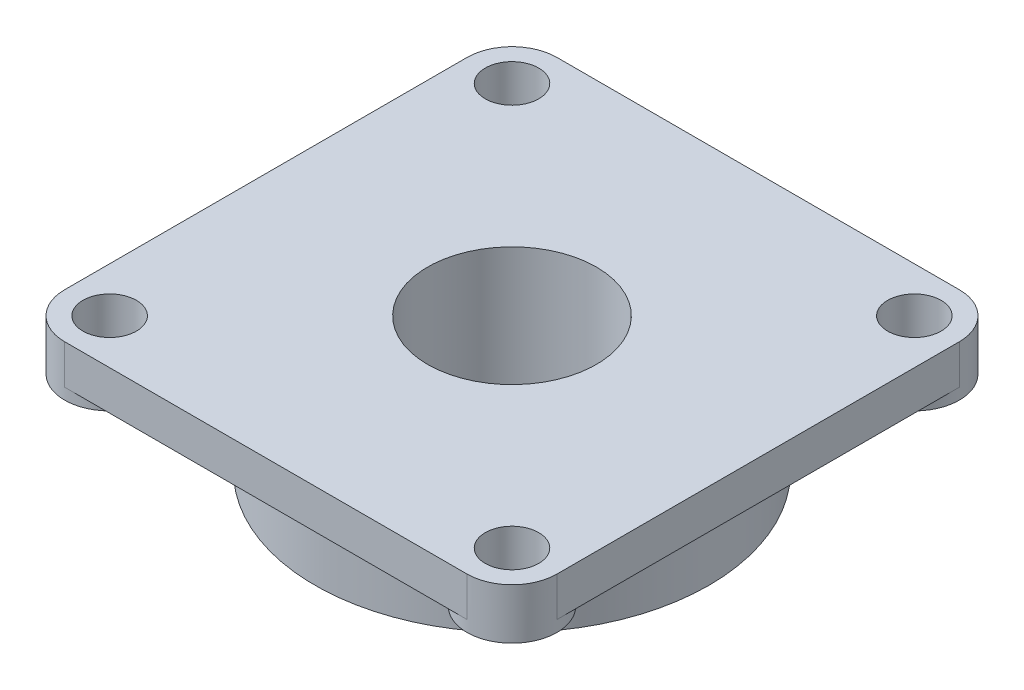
ISO-10303-21;
HEADER;
FILE_DESCRIPTION(('STEP AP214'),'2;1');
FILE_NAME('part.step','',(''),(''),'','','');
FILE_SCHEMA(('AUTOMOTIVE_DESIGN { 1 0 10303 214 1 1 1 1 }'));
ENDSEC;
DATA;
#1=APPLICATION_CONTEXT('core data for automotive mechanical design processes');
#2=APPLICATION_PROTOCOL_DEFINITION('international standard','automotive_design',2000,#1);
#3=PRODUCT_CONTEXT('',#1,'mechanical');
#4=PRODUCT('Part','Part','',(#3));
#5=PRODUCT_RELATED_PRODUCT_CATEGORY('part','',(#4));
#6=PRODUCT_DEFINITION_FORMATION('','',#4);
#7=PRODUCT_DEFINITION_CONTEXT('part definition',#1,'design');
#8=PRODUCT_DEFINITION('design','',#6,#7);
#9=PRODUCT_DEFINITION_SHAPE('','',#8);
#10=(LENGTH_UNIT() NAMED_UNIT(*) SI_UNIT(.MILLI.,.METRE.));
#11=(NAMED_UNIT(*) PLANE_ANGLE_UNIT() SI_UNIT($,.RADIAN.));
#12=(NAMED_UNIT(*) SI_UNIT($,.STERADIAN.) SOLID_ANGLE_UNIT());
#13=UNCERTAINTY_MEASURE_WITH_UNIT(LENGTH_MEASURE(1.E-05),#10,'distance_accuracy_value','');
#14=(GEOMETRIC_REPRESENTATION_CONTEXT(3) GLOBAL_UNCERTAINTY_ASSIGNED_CONTEXT((#13)) GLOBAL_UNIT_ASSIGNED_CONTEXT((#10,
#11,#12)) REPRESENTATION_CONTEXT('',''));
#15=CARTESIAN_POINT('',(0.,0.,0.));
#16=DIRECTION('',(0.,0.,1.));
#17=DIRECTION('',(1.,0.,0.));
#18=AXIS2_PLACEMENT_3D('',#15,#16,#17);
#19=CARTESIAN_POINT('',(-71.5,0.,71.5));
#20=DIRECTION('',(0.,-1.,0.));
#21=DIRECTION('',(0.,0.,-1.));
#22=AXIS2_PLACEMENT_3D('',#19,#20,#21);
#23=CYLINDRICAL_SURFACE('',#22,9.5);
#24=CARTESIAN_POINT('',(-71.5,0.,71.5));
#25=DIRECTION('',(0.,-1.,0.));
#26=DIRECTION('',(0.,0.,-1.));
#27=AXIS2_PLACEMENT_3D('',#24,#25,#26);
#28=CIRCLE('',#27,9.5);
#29=CARTESIAN_POINT('',(-71.5,0.,62.));
#30=VERTEX_POINT('',#29);
#31=EDGE_CURVE('E406',#30,#30,#28,.F.);
#32=ORIENTED_EDGE('',*,*,#31,.T.);
#33=EDGE_LOOP('',(#32));
#34=FACE_BOUND('',#33,.T.);
#35=CARTESIAN_POINT('',(-71.5,-18.,71.5));
#36=DIRECTION('',(0.,-1.,0.));
#37=DIRECTION('',(0.,0.,-1.));
#38=AXIS2_PLACEMENT_3D('',#35,#36,#37);
#39=CIRCLE('',#38,9.5);
#40=CARTESIAN_POINT('',(-71.5,-18.,62.));
#41=VERTEX_POINT('',#40);
#42=EDGE_CURVE('E212',#41,#41,#39,.F.);
#43=ORIENTED_EDGE('',*,*,#42,.F.);
#44=EDGE_LOOP('',(#43));
#45=FACE_BOUND('',#44,.T.);
#46=ADVANCED_FACE('F16',(#34,#45),#23,.F.);
#47=CARTESIAN_POINT('',(-87.5,0.,-71.5));
#48=DIRECTION('',(-1.,0.,0.));
#49=DIRECTION('',(0.,-1.,0.));
#50=AXIS2_PLACEMENT_3D('',#47,#48,#49);
#51=PLANE('',#50);
#52=DIRECTION('',(0.,0.,-1.));
#53=VECTOR('',#52,1.);
#54=CARTESIAN_POINT('',(-87.5,0.,0.));
#55=LINE('',#54,#53);
#56=CARTESIAN_POINT('',(-87.5,0.,71.5));
#57=VERTEX_POINT('',#56);
#58=CARTESIAN_POINT('',(-87.5,0.,-71.5));
#59=VERTEX_POINT('',#58);
#60=EDGE_CURVE('E418',#57,#59,#55,.T.);
#61=ORIENTED_EDGE('',*,*,#60,.T.);
#62=DIRECTION('',(0.,-1.,0.));
#63=VECTOR('',#62,1.);
#64=CARTESIAN_POINT('',(-87.5,0.,-71.5));
#65=LINE('',#64,#63);
#66=CARTESIAN_POINT('',(-87.5,-14.,-71.5));
#67=VERTEX_POINT('',#66);
#68=EDGE_CURVE('E337',#67,#59,#65,.F.);
#69=ORIENTED_EDGE('',*,*,#68,.F.);
#70=DIRECTION('',(0.,0.,-1.));
#71=VECTOR('',#70,1.);
#72=CARTESIAN_POINT('',(-87.5,-14.,0.));
#73=LINE('',#72,#71);
#74=CARTESIAN_POINT('',(-87.5,-14.,71.5));
#75=VERTEX_POINT('',#74);
#76=EDGE_CURVE('E213',#75,#67,#73,.T.);
#77=ORIENTED_EDGE('',*,*,#76,.F.);
#78=DIRECTION('',(0.,-1.,0.));
#79=VECTOR('',#78,1.);
#80=CARTESIAN_POINT('',(-87.5,0.,71.5));
#81=LINE('',#80,#79);
#82=EDGE_CURVE('E341',#75,#57,#81,.F.);
#83=ORIENTED_EDGE('',*,*,#82,.T.);
#84=EDGE_LOOP('',(#61,#69,#77,#83));
#85=FACE_BOUND('',#84,.T.);
#86=ADVANCED_FACE('F429',(#85),#51,.T.);
#87=CARTESIAN_POINT('',(-71.5,0.,-71.5));
#88=DIRECTION('',(0.,-1.,0.));
#89=DIRECTION('',(0.,0.,-1.));
#90=AXIS2_PLACEMENT_3D('',#87,#88,#89);
#91=CYLINDRICAL_SURFACE('',#90,9.5);
#92=CARTESIAN_POINT('',(-71.5,0.,-71.5));
#93=DIRECTION('',(0.,-1.,0.));
#94=DIRECTION('',(0.,0.,-1.));
#95=AXIS2_PLACEMENT_3D('',#92,#93,#94);
#96=CIRCLE('',#95,9.5);
#97=CARTESIAN_POINT('',(-71.5,0.,-81.));
#98=VERTEX_POINT('',#97);
#99=EDGE_CURVE('E409',#98,#98,#96,.F.);
#100=ORIENTED_EDGE('',*,*,#99,.T.);
#101=EDGE_LOOP('',(#100));
#102=FACE_BOUND('',#101,.T.);
#103=CARTESIAN_POINT('',(-71.5,-18.,-71.5));
#104=DIRECTION('',(0.,-1.,0.));
#105=DIRECTION('',(0.,0.,-1.));
#106=AXIS2_PLACEMENT_3D('',#103,#104,#105);
#107=CIRCLE('',#106,9.5);
#108=CARTESIAN_POINT('',(-71.5,-18.,-81.));
#109=VERTEX_POINT('',#108);
#110=EDGE_CURVE('E302',#109,#109,#107,.F.);
#111=ORIENTED_EDGE('',*,*,#110,.F.);
#112=EDGE_LOOP('',(#111));
#113=FACE_BOUND('',#112,.T.);
#114=ADVANCED_FACE('F693',(#102,#113),#91,.F.);
#115=CARTESIAN_POINT('',(-71.5,0.,-71.5));
#116=DIRECTION('',(0.,-1.,0.));
#117=DIRECTION('',(0.,0.,-1.));
#118=AXIS2_PLACEMENT_3D('',#115,#116,#117);
#119=CYLINDRICAL_SURFACE('',#118,16.);
#120=DIRECTION('',(0.,1.,0.));
#121=VECTOR('',#120,1.);
#122=CARTESIAN_POINT('',(-60.1862915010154,0.,-82.8137084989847));
#123=LINE('',#122,#121);
#124=CARTESIAN_POINT('',(-60.1862915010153,-18.,-82.8137084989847));
#125=VERTEX_POINT('',#124);
#126=CARTESIAN_POINT('',(-60.1862915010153,-14.,-82.8137084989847));
#127=VERTEX_POINT('',#126);
#128=EDGE_CURVE('E235',#125,#127,#123,.T.);
#129=ORIENTED_EDGE('',*,*,#128,.F.);
#130=CARTESIAN_POINT('',(-71.5,-18.,-71.5));
#131=DIRECTION('',(0.,-1.,0.));
#132=DIRECTION('',(0.,0.,-1.));
#133=AXIS2_PLACEMENT_3D('',#130,#131,#132);
#134=CIRCLE('',#133,16.);
#135=CARTESIAN_POINT('',(-82.8137084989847,-18.,-60.1862915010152));
#136=VERTEX_POINT('',#135);
#137=EDGE_CURVE('E225',#136,#125,#134,.T.);
#138=ORIENTED_EDGE('',*,*,#137,.F.);
#139=DIRECTION('',(0.,1.,0.));
#140=VECTOR('',#139,1.);
#141=CARTESIAN_POINT('',(-82.8137084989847,0.,-60.1862915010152));
#142=LINE('',#141,#140);
#143=CARTESIAN_POINT('',(-82.8137084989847,-14.,-60.1862915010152));
#144=VERTEX_POINT('',#143);
#145=EDGE_CURVE('E226',#144,#136,#142,.F.);
#146=ORIENTED_EDGE('',*,*,#145,.F.);
#147=CARTESIAN_POINT('',(-71.5,-14.,-71.5));
#148=DIRECTION('',(0.,-1.,0.));
#149=DIRECTION('',(0.,0.,-1.));
#150=AXIS2_PLACEMENT_3D('',#147,#148,#149);
#151=CIRCLE('',#150,16.);
#152=EDGE_CURVE('E216',#67,#144,#151,.F.);
#153=ORIENTED_EDGE('',*,*,#152,.F.);
#154=ORIENTED_EDGE('',*,*,#68,.T.);
#155=CARTESIAN_POINT('',(-71.5,0.,-71.5));
#156=DIRECTION('',(0.,-1.,0.));
#157=DIRECTION('',(0.,0.,-1.));
#158=AXIS2_PLACEMENT_3D('',#155,#156,#157);
#159=CIRCLE('',#158,16.);
#160=CARTESIAN_POINT('',(-71.5,0.,-87.5));
#161=VERTEX_POINT('',#160);
#162=EDGE_CURVE('E416',#59,#161,#159,.T.);
#163=ORIENTED_EDGE('',*,*,#162,.T.);
#164=DIRECTION('',(0.,1.,0.));
#165=VECTOR('',#164,1.);
#166=CARTESIAN_POINT('',(-71.5,0.,-87.5));
#167=LINE('',#166,#165);
#168=CARTESIAN_POINT('',(-71.5,-14.,-87.5));
#169=VERTEX_POINT('',#168);
#170=EDGE_CURVE('E334',#169,#161,#167,.T.);
#171=ORIENTED_EDGE('',*,*,#170,.F.);
#172=CARTESIAN_POINT('',(-71.5,-14.,-71.5));
#173=DIRECTION('',(0.,-1.,0.));
#174=DIRECTION('',(0.,0.,-1.));
#175=AXIS2_PLACEMENT_3D('',#172,#173,#174);
#176=CIRCLE('',#175,16.);
#177=EDGE_CURVE('E231',#127,#169,#176,.F.);
#178=ORIENTED_EDGE('',*,*,#177,.F.);
#179=EDGE_LOOP('',(#129,#138,#146,#153,#154,#163,#171,#178));
#180=FACE_BOUND('',#179,.T.);
#181=ADVANCED_FACE('F434',(#180),#119,.T.);
#182=CARTESIAN_POINT('',(71.5,0.,-87.5));
#183=DIRECTION('',(0.,0.,-1.));
#184=DIRECTION('',(0.,1.,0.));
#185=AXIS2_PLACEMENT_3D('',#182,#183,#184);
#186=PLANE('',#185);
#187=DIRECTION('',(1.,0.,0.));
#188=VECTOR('',#187,1.);
#189=CARTESIAN_POINT('',(0.,0.,-87.5));
#190=LINE('',#189,#188);
#191=CARTESIAN_POINT('',(71.5,0.,-87.5));
#192=VERTEX_POINT('',#191);
#193=EDGE_CURVE('E415',#161,#192,#190,.T.);
#194=ORIENTED_EDGE('',*,*,#193,.T.);
#195=DIRECTION('',(0.,-1.,0.));
#196=VECTOR('',#195,1.);
#197=CARTESIAN_POINT('',(71.5,0.,-87.5));
#198=LINE('',#197,#196);
#199=CARTESIAN_POINT('',(71.5,-14.,-87.5));
#200=VERTEX_POINT('',#199);
#201=EDGE_CURVE('E175',#200,#192,#198,.F.);
#202=ORIENTED_EDGE('',*,*,#201,.F.);
#203=DIRECTION('',(1.,0.,0.));
#204=VECTOR('',#203,1.);
#205=CARTESIAN_POINT('',(0.,-14.,-87.5));
#206=LINE('',#205,#204);
#207=EDGE_CURVE('E227',#169,#200,#206,.T.);
#208=ORIENTED_EDGE('',*,*,#207,.F.);
#209=ORIENTED_EDGE('',*,*,#170,.T.);
#210=EDGE_LOOP('',(#194,#202,#208,#209));
#211=FACE_BOUND('',#210,.T.);
#212=ADVANCED_FACE('F480',(#211),#186,.T.);
#213=CARTESIAN_POINT('',(71.5,0.,-71.5));
#214=DIRECTION('',(0.,-1.,0.));
#215=DIRECTION('',(0.,0.,-1.));
#216=AXIS2_PLACEMENT_3D('',#213,#214,#215);
#217=CYLINDRICAL_SURFACE('',#216,9.5);
#218=CARTESIAN_POINT('',(71.5,0.,-71.5));
#219=DIRECTION('',(0.,-1.,0.));
#220=DIRECTION('',(0.,0.,-1.));
#221=AXIS2_PLACEMENT_3D('',#218,#219,#220);
#222=CIRCLE('',#221,9.5);
#223=CARTESIAN_POINT('',(71.5,0.,-81.));
#224=VERTEX_POINT('',#223);
#225=EDGE_CURVE('E412',#224,#224,#222,.F.);
#226=ORIENTED_EDGE('',*,*,#225,.T.);
#227=EDGE_LOOP('',(#226));
#228=FACE_BOUND('',#227,.T.);
#229=CARTESIAN_POINT('',(71.5,-18.,-71.5));
#230=DIRECTION('',(0.,-1.,0.));
#231=DIRECTION('',(0.,0.,-1.));
#232=AXIS2_PLACEMENT_3D('',#229,#230,#231);
#233=CIRCLE('',#232,9.5);
#234=CARTESIAN_POINT('',(71.5,-18.,-81.));
#235=VERTEX_POINT('',#234);
#236=EDGE_CURVE('E287',#235,#235,#233,.F.);
#237=ORIENTED_EDGE('',*,*,#236,.F.);
#238=EDGE_LOOP('',(#237));
#239=FACE_BOUND('',#238,.T.);
#240=ADVANCED_FACE('F671',(#228,#239),#217,.F.);
#241=CARTESIAN_POINT('',(71.5,0.,-71.5));
#242=DIRECTION('',(0.,-1.,0.));
#243=DIRECTION('',(0.,0.,-1.));
#244=AXIS2_PLACEMENT_3D('',#241,#242,#243);
#245=CYLINDRICAL_SURFACE('',#244,16.);
#246=DIRECTION('',(0.,1.,0.));
#247=VECTOR('',#246,1.);
#248=CARTESIAN_POINT('',(82.8137084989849,0.,-60.1862915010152));
#249=LINE('',#248,#247);
#250=CARTESIAN_POINT('',(82.8137084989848,-18.,-60.1862915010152));
#251=VERTEX_POINT('',#250);
#252=CARTESIAN_POINT('',(82.8137084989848,-14.,-60.1862915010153));
#253=VERTEX_POINT('',#252);
#254=EDGE_CURVE('E247',#251,#253,#249,.T.);
#255=ORIENTED_EDGE('',*,*,#254,.F.);
#256=CARTESIAN_POINT('',(71.5,-18.,-71.5));
#257=DIRECTION('',(0.,-1.,0.));
#258=DIRECTION('',(0.,0.,-1.));
#259=AXIS2_PLACEMENT_3D('',#256,#257,#258);
#260=CIRCLE('',#259,16.);
#261=CARTESIAN_POINT('',(60.1862915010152,-18.,-82.8137084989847));
#262=VERTEX_POINT('',#261);
#263=EDGE_CURVE('E239',#262,#251,#260,.T.);
#264=ORIENTED_EDGE('',*,*,#263,.F.);
#265=DIRECTION('',(0.,1.,0.));
#266=VECTOR('',#265,1.);
#267=CARTESIAN_POINT('',(60.1862915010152,0.,-82.8137084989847));
#268=LINE('',#267,#266);
#269=CARTESIAN_POINT('',(60.1862915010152,-14.,-82.8137084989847));
#270=VERTEX_POINT('',#269);
#271=EDGE_CURVE('E240',#270,#262,#268,.F.);
#272=ORIENTED_EDGE('',*,*,#271,.F.);
#273=CARTESIAN_POINT('',(71.5,-14.,-71.5));
#274=DIRECTION('',(0.,-1.,0.));
#275=DIRECTION('',(0.,0.,-1.));
#276=AXIS2_PLACEMENT_3D('',#273,#274,#275);
#277=CIRCLE('',#276,16.);
#278=EDGE_CURVE('E230',#200,#270,#277,.F.);
#279=ORIENTED_EDGE('',*,*,#278,.F.);
#280=ORIENTED_EDGE('',*,*,#201,.T.);
#281=CARTESIAN_POINT('',(71.5,0.,-71.5));
#282=DIRECTION('',(0.,-1.,0.));
#283=DIRECTION('',(0.,0.,-1.));
#284=AXIS2_PLACEMENT_3D('',#281,#282,#283);
#285=CIRCLE('',#284,16.);
#286=CARTESIAN_POINT('',(87.5,0.,-71.5));
#287=VERTEX_POINT('',#286);
#288=EDGE_CURVE('E20',#192,#287,#285,.T.);
#289=ORIENTED_EDGE('',*,*,#288,.T.);
#290=DIRECTION('',(0.,1.,0.));
#291=VECTOR('',#290,1.);
#292=CARTESIAN_POINT('',(87.5,0.,-71.5));
#293=LINE('',#292,#291);
#294=CARTESIAN_POINT('',(87.5,-14.,-71.5));
#295=VERTEX_POINT('',#294);
#296=EDGE_CURVE('E182',#295,#287,#293,.T.);
#297=ORIENTED_EDGE('',*,*,#296,.F.);
#298=CARTESIAN_POINT('',(71.5,-14.,-71.5));
#299=DIRECTION('',(0.,-1.,0.));
#300=DIRECTION('',(0.,0.,-1.));
#301=AXIS2_PLACEMENT_3D('',#298,#299,#300);
#302=CIRCLE('',#301,16.);
#303=EDGE_CURVE('E243',#253,#295,#302,.F.);
#304=ORIENTED_EDGE('',*,*,#303,.F.);
#305=EDGE_LOOP('',(#255,#264,#272,#279,#280,#289,#297,#304));
#306=FACE_BOUND('',#305,.T.);
#307=ADVANCED_FACE('F180',(#306),#245,.T.);
#308=CARTESIAN_POINT('',(87.5,0.,71.5));
#309=DIRECTION('',(1.,0.,0.));
#310=DIRECTION('',(0.,1.,0.));
#311=AXIS2_PLACEMENT_3D('',#308,#309,#310);
#312=PLANE('',#311);
#313=DIRECTION('',(0.,0.,-1.));
#314=VECTOR('',#313,1.);
#315=CARTESIAN_POINT('',(87.5,0.,0.));
#316=LINE('',#315,#314);
#317=CARTESIAN_POINT('',(87.5,0.,71.5));
#318=VERTEX_POINT('',#317);
#319=EDGE_CURVE('E187',#287,#318,#316,.F.);
#320=ORIENTED_EDGE('',*,*,#319,.T.);
#321=DIRECTION('',(0.,-1.,0.));
#322=VECTOR('',#321,1.);
#323=CARTESIAN_POINT('',(87.5,0.,71.5));
#324=LINE('',#323,#322);
#325=CARTESIAN_POINT('',(87.5,-14.,71.5));
#326=VERTEX_POINT('',#325);
#327=EDGE_CURVE('E195',#326,#318,#324,.F.);
#328=ORIENTED_EDGE('',*,*,#327,.F.);
#329=DIRECTION('',(0.,0.,-1.));
#330=VECTOR('',#329,1.);
#331=CARTESIAN_POINT('',(87.5,-14.,0.));
#332=LINE('',#331,#330);
#333=EDGE_CURVE('E193',#295,#326,#332,.F.);
#334=ORIENTED_EDGE('',*,*,#333,.F.);
#335=ORIENTED_EDGE('',*,*,#296,.T.);
#336=EDGE_LOOP('',(#320,#328,#334,#335));
#337=FACE_BOUND('',#336,.T.);
#338=ADVANCED_FACE('F190',(#337),#312,.T.);
#339=CARTESIAN_POINT('',(71.5000000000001,0.,71.5));
#340=DIRECTION('',(0.,-1.,0.));
#341=DIRECTION('',(0.,0.,-1.));
#342=AXIS2_PLACEMENT_3D('',#339,#340,#341);
#343=CYLINDRICAL_SURFACE('',#342,9.5);
#344=CARTESIAN_POINT('',(71.5000000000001,0.,71.5));
#345=DIRECTION('',(0.,-1.,0.));
#346=DIRECTION('',(0.,0.,-1.));
#347=AXIS2_PLACEMENT_3D('',#344,#345,#346);
#348=CIRCLE('',#347,9.5);
#349=CARTESIAN_POINT('',(71.5000000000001,0.,62.));
#350=VERTEX_POINT('',#349);
#351=EDGE_CURVE('E323',#350,#350,#348,.F.);
#352=ORIENTED_EDGE('',*,*,#351,.T.);
#353=EDGE_LOOP('',(#352));
#354=FACE_BOUND('',#353,.T.);
#355=CARTESIAN_POINT('',(71.5000000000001,-18.,71.5));
#356=DIRECTION('',(0.,-1.,0.));
#357=DIRECTION('',(0.,0.,-1.));
#358=AXIS2_PLACEMENT_3D('',#355,#356,#357);
#359=CIRCLE('',#358,9.5);
#360=CARTESIAN_POINT('',(71.5000000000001,-18.,62.));
#361=VERTEX_POINT('',#360);
#362=EDGE_CURVE('E272',#361,#361,#359,.F.);
#363=ORIENTED_EDGE('',*,*,#362,.F.);
#364=EDGE_LOOP('',(#363));
#365=FACE_BOUND('',#364,.T.);
#366=ADVANCED_FACE('F649',(#354,#365),#343,.F.);
#367=CARTESIAN_POINT('',(71.5,0.,71.5));
#368=DIRECTION('',(0.,-1.,0.));
#369=DIRECTION('',(0.,0.,-1.));
#370=AXIS2_PLACEMENT_3D('',#367,#368,#369);
#371=CYLINDRICAL_SURFACE('',#370,16.);
#372=DIRECTION('',(0.,1.,0.));
#373=VECTOR('',#372,1.);
#374=CARTESIAN_POINT('',(60.1862915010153,0.,82.8137084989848));
#375=LINE('',#374,#373);
#376=CARTESIAN_POINT('',(60.1862915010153,-18.,82.8137084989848));
#377=VERTEX_POINT('',#376);
#378=CARTESIAN_POINT('',(60.1862915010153,-14.,82.8137084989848));
#379=VERTEX_POINT('',#378);
#380=EDGE_CURVE('E263',#377,#379,#375,.T.);
#381=ORIENTED_EDGE('',*,*,#380,.F.);
#382=CARTESIAN_POINT('',(71.5,-18.,71.5));
#383=DIRECTION('',(0.,-1.,0.));
#384=DIRECTION('',(0.,0.,-1.));
#385=AXIS2_PLACEMENT_3D('',#382,#383,#384);
#386=CIRCLE('',#385,16.);
#387=CARTESIAN_POINT('',(82.8137084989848,-18.,60.1862915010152));
#388=VERTEX_POINT('',#387);
#389=EDGE_CURVE('E251',#388,#377,#386,.T.);
#390=ORIENTED_EDGE('',*,*,#389,.F.);
#391=DIRECTION('',(0.,1.,0.));
#392=VECTOR('',#391,1.);
#393=CARTESIAN_POINT('',(82.8137084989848,0.,60.1862915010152));
#394=LINE('',#393,#392);
#395=CARTESIAN_POINT('',(82.8137084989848,-14.,60.1862915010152));
#396=VERTEX_POINT('',#395);
#397=EDGE_CURVE('E252',#396,#388,#394,.F.);
#398=ORIENTED_EDGE('',*,*,#397,.F.);
#399=CARTESIAN_POINT('',(71.5,-14.,71.5));
#400=DIRECTION('',(0.,-1.,0.));
#401=DIRECTION('',(0.,0.,-1.));
#402=AXIS2_PLACEMENT_3D('',#399,#400,#401);
#403=CIRCLE('',#402,16.);
#404=EDGE_CURVE('E242',#326,#396,#403,.F.);
#405=ORIENTED_EDGE('',*,*,#404,.F.);
#406=ORIENTED_EDGE('',*,*,#327,.T.);
#407=CARTESIAN_POINT('',(71.5,0.,71.5));
#408=DIRECTION('',(0.,-1.,0.));
#409=DIRECTION('',(0.,0.,-1.));
#410=AXIS2_PLACEMENT_3D('',#407,#408,#409);
#411=CIRCLE('',#410,16.);
#412=CARTESIAN_POINT('',(71.5,0.,87.5));
#413=VERTEX_POINT('',#412);
#414=EDGE_CURVE('E202',#318,#413,#411,.T.);
#415=ORIENTED_EDGE('',*,*,#414,.T.);
#416=DIRECTION('',(0.,-1.,0.));
#417=VECTOR('',#416,1.);
#418=CARTESIAN_POINT('',(71.5,0.,87.5));
#419=LINE('',#418,#417);
#420=CARTESIAN_POINT('',(71.5,-14.,87.5));
#421=VERTEX_POINT('',#420);
#422=EDGE_CURVE('E324',#421,#413,#419,.F.);
#423=ORIENTED_EDGE('',*,*,#422,.F.);
#424=CARTESIAN_POINT('',(71.5,-14.,71.5));
#425=DIRECTION('',(0.,-1.,0.));
#426=DIRECTION('',(0.,0.,-1.));
#427=AXIS2_PLACEMENT_3D('',#424,#425,#426);
#428=CIRCLE('',#427,16.);
#429=EDGE_CURVE('E261',#379,#421,#428,.F.);
#430=ORIENTED_EDGE('',*,*,#429,.F.);
#431=EDGE_LOOP('',(#381,#390,#398,#405,#406,#415,#423,#430));
#432=FACE_BOUND('',#431,.T.);
#433=ADVANCED_FACE('F459',(#432),#371,.T.);
#434=CARTESIAN_POINT('',(-71.5,0.,87.5));
#435=DIRECTION('',(0.,0.,1.));
#436=DIRECTION('',(0.,-1.,0.));
#437=AXIS2_PLACEMENT_3D('',#434,#435,#436);
#438=PLANE('',#437);
#439=DIRECTION('',(1.,0.,0.));
#440=VECTOR('',#439,1.);
#441=CARTESIAN_POINT('',(0.,0.,87.5));
#442=LINE('',#441,#440);
#443=CARTESIAN_POINT('',(-71.5,0.,87.5));
#444=VERTEX_POINT('',#443);
#445=EDGE_CURVE('E204',#413,#444,#442,.F.);
#446=ORIENTED_EDGE('',*,*,#445,.T.);
#447=DIRECTION('',(0.,-1.,0.));
#448=VECTOR('',#447,1.);
#449=CARTESIAN_POINT('',(-71.5,0.,87.5));
#450=LINE('',#449,#448);
#451=CARTESIAN_POINT('',(-71.5,-14.,87.5));
#452=VERTEX_POINT('',#451);
#453=EDGE_CURVE('E188',#444,#452,#450,.T.);
#454=ORIENTED_EDGE('',*,*,#453,.T.);
#455=DIRECTION('',(1.,0.,0.));
#456=VECTOR('',#455,1.);
#457=CARTESIAN_POINT('',(0.,-14.,87.5));
#458=LINE('',#457,#456);
#459=EDGE_CURVE('E258',#421,#452,#458,.F.);
#460=ORIENTED_EDGE('',*,*,#459,.F.);
#461=ORIENTED_EDGE('',*,*,#422,.T.);
#462=EDGE_LOOP('',(#446,#454,#460,#461));
#463=FACE_BOUND('',#462,.T.);
#464=ADVANCED_FACE('F424',(#463),#438,.T.);
#465=CARTESIAN_POINT('',(-71.5,-14.,71.5));
#466=DIRECTION('',(0.,-1.,0.));
#467=DIRECTION('',(0.,0.,-1.));
#468=AXIS2_PLACEMENT_3D('',#465,#466,#467);
#469=CYLINDRICAL_SURFACE('',#468,16.);
#470=DIRECTION('',(0.,1.,0.));
#471=VECTOR('',#470,1.);
#472=CARTESIAN_POINT('',(-60.1862915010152,0.,82.8137084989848));
#473=LINE('',#472,#471);
#474=CARTESIAN_POINT('',(-60.1862915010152,-14.,82.8137084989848));
#475=VERTEX_POINT('',#474);
#476=CARTESIAN_POINT('',(-60.1862915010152,-18.,82.8137084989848));
#477=VERTEX_POINT('',#476);
#478=EDGE_CURVE('E320',#475,#477,#473,.F.);
#479=ORIENTED_EDGE('',*,*,#478,.F.);
#480=CARTESIAN_POINT('',(-71.5,-14.,71.5));
#481=DIRECTION('',(0.,-1.,0.));
#482=DIRECTION('',(0.,0.,-1.));
#483=AXIS2_PLACEMENT_3D('',#480,#481,#482);
#484=CIRCLE('',#483,16.);
#485=EDGE_CURVE('E257',#452,#475,#484,.F.);
#486=ORIENTED_EDGE('',*,*,#485,.F.);
#487=ORIENTED_EDGE('',*,*,#453,.F.);
#488=CARTESIAN_POINT('',(-71.5,0.,71.5));
#489=DIRECTION('',(0.,-1.,0.));
#490=DIRECTION('',(0.,0.,-1.));
#491=AXIS2_PLACEMENT_3D('',#488,#489,#490);
#492=CIRCLE('',#491,16.);
#493=EDGE_CURVE('E419',#444,#57,#492,.T.);
#494=ORIENTED_EDGE('',*,*,#493,.T.);
#495=ORIENTED_EDGE('',*,*,#82,.F.);
#496=CARTESIAN_POINT('',(-71.5,-14.,71.5));
#497=DIRECTION('',(0.,-1.,0.));
#498=DIRECTION('',(0.,0.,-1.));
#499=AXIS2_PLACEMENT_3D('',#496,#497,#498);
#500=CIRCLE('',#499,16.);
#501=CARTESIAN_POINT('',(-82.8137084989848,-14.,60.1862915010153));
#502=VERTEX_POINT('',#501);
#503=EDGE_CURVE('E217',#502,#75,#500,.F.);
#504=ORIENTED_EDGE('',*,*,#503,.F.);
#505=DIRECTION('',(0.,1.,0.));
#506=VECTOR('',#505,1.);
#507=CARTESIAN_POINT('',(-82.8137084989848,0.,60.1862915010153));
#508=LINE('',#507,#506);
#509=CARTESIAN_POINT('',(-82.8137084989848,-18.,60.1862915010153));
#510=VERTEX_POINT('',#509);
#511=EDGE_CURVE('E221',#510,#502,#508,.T.);
#512=ORIENTED_EDGE('',*,*,#511,.F.);
#513=CARTESIAN_POINT('',(-71.5,-18.,71.5));
#514=DIRECTION('',(0.,-1.,0.));
#515=DIRECTION('',(0.,0.,-1.));
#516=AXIS2_PLACEMENT_3D('',#513,#514,#515);
#517=CIRCLE('',#516,16.);
#518=EDGE_CURVE('E211',#477,#510,#517,.T.);
#519=ORIENTED_EDGE('',*,*,#518,.F.);
#520=EDGE_LOOP('',(#479,#486,#487,#494,#495,#504,#512,#519));
#521=FACE_BOUND('',#520,.T.);
#522=ADVANCED_FACE('F442',(#521),#469,.T.);
#523=CARTESIAN_POINT('',(0.,0.,0.));
#524=DIRECTION('',(0.,-1.,0.));
#525=DIRECTION('',(0.,0.,-1.));
#526=AXIS2_PLACEMENT_3D('',#523,#524,#525);
#527=PLANE('',#526);
#528=ORIENTED_EDGE('',*,*,#351,.F.);
#529=EDGE_LOOP('',(#528));
#530=FACE_BOUND('',#529,.T.);
#531=ORIENTED_EDGE('',*,*,#31,.F.);
#532=EDGE_LOOP('',(#531));
#533=FACE_BOUND('',#532,.T.);
#534=ORIENTED_EDGE('',*,*,#99,.F.);
#535=EDGE_LOOP('',(#534));
#536=FACE_BOUND('',#535,.T.);
#537=ORIENTED_EDGE('',*,*,#225,.F.);
#538=EDGE_LOOP('',(#537));
#539=FACE_BOUND('',#538,.T.);
#540=ORIENTED_EDGE('',*,*,#162,.F.);
#541=ORIENTED_EDGE('',*,*,#60,.F.);
#542=ORIENTED_EDGE('',*,*,#493,.F.);
#543=ORIENTED_EDGE('',*,*,#445,.F.);
#544=ORIENTED_EDGE('',*,*,#414,.F.);
#545=ORIENTED_EDGE('',*,*,#319,.F.);
#546=ORIENTED_EDGE('',*,*,#288,.F.);
#547=ORIENTED_EDGE('',*,*,#193,.F.);
#548=EDGE_LOOP('',(#540,#541,#542,#543,#544,#545,#546,#547));
#549=FACE_BOUND('',#548,.T.);
#550=CARTESIAN_POINT('',(0.,0.,0.));
#551=DIRECTION('',(0.,1.,0.));
#552=DIRECTION('',(0.,0.,1.));
#553=AXIS2_PLACEMENT_3D('',#550,#551,#552);
#554=CIRCLE('',#553,30.);
#555=CARTESIAN_POINT('',(0.,0.,30.));
#556=VERTEX_POINT('',#555);
#557=EDGE_CURVE('E256',#556,#556,#554,.F.);
#558=ORIENTED_EDGE('',*,*,#557,.T.);
#559=EDGE_LOOP('',(#558));
#560=FACE_BOUND('',#559,.T.);
#561=ADVANCED_FACE('F199',(#530,#533,#536,#539,#549,#560),#527,.F.);
#562=CARTESIAN_POINT('',(-60.1862915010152,0.,82.8137084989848));
#563=DIRECTION('',(0.707106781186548,0.,0.707106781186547));
#564=DIRECTION('',(0.707106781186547,0.,-0.707106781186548));
#565=AXIS2_PLACEMENT_3D('',#562,#563,#564);
#566=PLANE('',#565);
#567=ORIENTED_EDGE('',*,*,#478,.T.);
#568=DIRECTION('',(-0.707106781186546,0.,0.707106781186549));
#569=VECTOR('',#568,1.);
#570=CARTESIAN_POINT('',(-36.8734267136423,-18.,59.5008437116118));
#571=LINE('',#570,#569);
#572=CARTESIAN_POINT('',(-36.8734267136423,-18.,59.5008437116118));
#573=VERTEX_POINT('',#572);
#574=EDGE_CURVE('E208',#573,#477,#571,.T.);
#575=ORIENTED_EDGE('',*,*,#574,.F.);
#576=DIRECTION('',(0.,-1.,0.));
#577=VECTOR('',#576,1.);
#578=CARTESIAN_POINT('',(-36.8734267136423,0.,59.5008437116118));
#579=LINE('',#578,#577);
#580=CARTESIAN_POINT('',(-36.8734267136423,-14.,59.5008437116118));
#581=VERTEX_POINT('',#580);
#582=EDGE_CURVE('E317',#581,#573,#579,.T.);
#583=ORIENTED_EDGE('',*,*,#582,.F.);
#584=DIRECTION('',(0.707106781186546,0.,-0.707106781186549));
#585=VECTOR('',#584,1.);
#586=CARTESIAN_POINT('',(-60.1862915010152,-14.,82.8137084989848));
#587=LINE('',#586,#585);
#588=EDGE_CURVE('E253',#475,#581,#587,.T.);
#589=ORIENTED_EDGE('',*,*,#588,.F.);
#590=EDGE_LOOP('',(#567,#575,#583,#589));
#591=FACE_BOUND('',#590,.T.);
#592=ADVANCED_FACE('F452',(#591),#566,.T.);
#593=CARTESIAN_POINT('',(39.1925745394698,-18.,39.1925745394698));
#594=DIRECTION('',(0.,-1.,0.));
#595=DIRECTION('',(0.,0.,-1.));
#596=AXIS2_PLACEMENT_3D('',#593,#594,#595);
#597=PLANE('',#596);
#598=ORIENTED_EDGE('',*,*,#518,.T.);
#599=DIRECTION('',(-0.707106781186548,0.,0.707106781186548));
#600=VECTOR('',#599,1.);
#601=CARTESIAN_POINT('',(-11.3137084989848,-18.,-11.3137084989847));
#602=LINE('',#601,#600);
#603=CARTESIAN_POINT('',(-59.5008437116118,-18.,36.8734267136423));
#604=VERTEX_POINT('',#603);
#605=EDGE_CURVE('E314',#604,#510,#602,.T.);
#606=ORIENTED_EDGE('',*,*,#605,.F.);
#607=CARTESIAN_POINT('',(0.,-18.,0.));
#608=DIRECTION('',(0.,-1.,0.));
#609=DIRECTION('',(1.,0.,0.));
#610=AXIS2_PLACEMENT_3D('',#607,#608,#609);
#611=CIRCLE('',#610,70.);
#612=EDGE_CURVE('E313',#573,#604,#611,.T.);
#613=ORIENTED_EDGE('',*,*,#612,.F.);
#614=ORIENTED_EDGE('',*,*,#574,.T.);
#615=EDGE_LOOP('',(#598,#606,#613,#614));
#616=FACE_BOUND('',#615,.T.);
#617=ORIENTED_EDGE('',*,*,#42,.T.);
#618=EDGE_LOOP('',(#617));
#619=FACE_BOUND('',#618,.T.);
#620=ADVANCED_FACE('F448',(#616,#619),#597,.T.);
#621=CARTESIAN_POINT('',(-11.3137084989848,0.,-11.3137084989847));
#622=DIRECTION('',(-0.707106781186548,0.,-0.707106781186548));
#623=DIRECTION('',(-0.707106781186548,0.,0.707106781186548));
#624=AXIS2_PLACEMENT_3D('',#621,#622,#623);
#625=PLANE('',#624);
#626=ORIENTED_EDGE('',*,*,#511,.T.);
#627=DIRECTION('',(-0.707106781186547,0.,0.707106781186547));
#628=VECTOR('',#627,1.);
#629=CARTESIAN_POINT('',(-59.5008437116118,-14.,36.8734267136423));
#630=LINE('',#629,#628);
#631=CARTESIAN_POINT('',(-59.5008437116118,-14.,36.8734267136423));
#632=VERTEX_POINT('',#631);
#633=EDGE_CURVE('E218',#632,#502,#630,.T.);
#634=ORIENTED_EDGE('',*,*,#633,.F.);
#635=DIRECTION('',(0.,-1.,0.));
#636=VECTOR('',#635,1.);
#637=CARTESIAN_POINT('',(-59.5008437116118,0.,36.8734267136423));
#638=LINE('',#637,#636);
#639=EDGE_CURVE('E310',#604,#632,#638,.F.);
#640=ORIENTED_EDGE('',*,*,#639,.F.);
#641=ORIENTED_EDGE('',*,*,#605,.T.);
#642=EDGE_LOOP('',(#626,#634,#640,#641));
#643=FACE_BOUND('',#642,.T.);
#644=ADVANCED_FACE('F445',(#643),#625,.T.);
#645=CARTESIAN_POINT('',(0.,-14.,0.));
#646=DIRECTION('',(0.,-1.,0.));
#647=DIRECTION('',(0.,0.,-1.));
#648=AXIS2_PLACEMENT_3D('',#645,#646,#647);
#649=PLANE('',#648);
#650=ORIENTED_EDGE('',*,*,#152,.T.);
#651=DIRECTION('',(0.707106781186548,0.,0.707106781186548));
#652=VECTOR('',#651,1.);
#653=CARTESIAN_POINT('',(-11.3137084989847,-14.,11.3137084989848));
#654=LINE('',#653,#652);
#655=CARTESIAN_POINT('',(-59.5008437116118,-14.,-36.8734267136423));
#656=VERTEX_POINT('',#655);
#657=EDGE_CURVE('E307',#656,#144,#654,.F.);
#658=ORIENTED_EDGE('',*,*,#657,.F.);
#659=CARTESIAN_POINT('',(0.,-14.,0.));
#660=DIRECTION('',(0.,-1.,0.));
#661=DIRECTION('',(1.,0.,0.));
#662=AXIS2_PLACEMENT_3D('',#659,#660,#661);
#663=CIRCLE('',#662,70.);
#664=EDGE_CURVE('E306',#632,#656,#663,.T.);
#665=ORIENTED_EDGE('',*,*,#664,.F.);
#666=ORIENTED_EDGE('',*,*,#633,.T.);
#667=ORIENTED_EDGE('',*,*,#503,.T.);
#668=ORIENTED_EDGE('',*,*,#76,.T.);
#669=EDGE_LOOP('',(#650,#658,#665,#666,#667,#668));
#670=FACE_BOUND('',#669,.T.);
#671=ADVANCED_FACE('F437',(#670),#649,.T.);
#672=CARTESIAN_POINT('',(-11.3137084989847,0.,11.3137084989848));
#673=DIRECTION('',(-0.707106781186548,0.,0.707106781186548));
#674=DIRECTION('',(0.707106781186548,0.,0.707106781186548));
#675=AXIS2_PLACEMENT_3D('',#672,#673,#674);
#676=PLANE('',#675);
#677=ORIENTED_EDGE('',*,*,#145,.T.);
#678=DIRECTION('',(-0.707106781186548,0.,-0.707106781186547));
#679=VECTOR('',#678,1.);
#680=CARTESIAN_POINT('',(-59.5008437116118,-18.,-36.8734267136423));
#681=LINE('',#680,#679);
#682=CARTESIAN_POINT('',(-59.5008437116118,-18.,-36.8734267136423));
#683=VERTEX_POINT('',#682);
#684=EDGE_CURVE('E222',#683,#136,#681,.T.);
#685=ORIENTED_EDGE('',*,*,#684,.F.);
#686=DIRECTION('',(0.,-1.,0.));
#687=VECTOR('',#686,1.);
#688=CARTESIAN_POINT('',(-59.5008437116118,0.,-36.8734267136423));
#689=LINE('',#688,#687);
#690=EDGE_CURVE('E303',#656,#683,#689,.T.);
#691=ORIENTED_EDGE('',*,*,#690,.F.);
#692=ORIENTED_EDGE('',*,*,#657,.T.);
#693=EDGE_LOOP('',(#677,#685,#691,#692));
#694=FACE_BOUND('',#693,.T.);
#695=ADVANCED_FACE('F492',(#694),#676,.T.);
#696=CARTESIAN_POINT('',(39.1925745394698,-18.,39.1925745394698));
#697=DIRECTION('',(0.,-1.,0.));
#698=DIRECTION('',(0.,0.,-1.));
#699=AXIS2_PLACEMENT_3D('',#696,#697,#698);
#700=PLANE('',#699);
#701=ORIENTED_EDGE('',*,*,#110,.T.);
#702=EDGE_LOOP('',(#701));
#703=FACE_BOUND('',#702,.T.);
#704=ORIENTED_EDGE('',*,*,#137,.T.);
#705=DIRECTION('',(-0.707106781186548,0.,-0.707106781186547));
#706=VECTOR('',#705,1.);
#707=CARTESIAN_POINT('',(82.8137084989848,-18.,60.1862915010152));
#708=LINE('',#707,#706);
#709=CARTESIAN_POINT('',(-36.8734267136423,-18.,-59.5008437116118));
#710=VERTEX_POINT('',#709);
#711=EDGE_CURVE('E299',#710,#125,#708,.T.);
#712=ORIENTED_EDGE('',*,*,#711,.F.);
#713=CARTESIAN_POINT('',(0.,-18.,0.));
#714=DIRECTION('',(0.,-1.,0.));
#715=DIRECTION('',(1.,0.,0.));
#716=AXIS2_PLACEMENT_3D('',#713,#714,#715);
#717=CIRCLE('',#716,70.);
#718=EDGE_CURVE('E298',#683,#710,#717,.T.);
#719=ORIENTED_EDGE('',*,*,#718,.F.);
#720=ORIENTED_EDGE('',*,*,#684,.T.);
#721=EDGE_LOOP('',(#704,#712,#719,#720));
#722=FACE_BOUND('',#721,.T.);
#723=ADVANCED_FACE('F490',(#703,#722),#700,.T.);
#724=CARTESIAN_POINT('',(82.8137084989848,0.,60.1862915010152));
#725=DIRECTION('',(0.707106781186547,0.,-0.707106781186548));
#726=DIRECTION('',(-0.707106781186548,0.,-0.707106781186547));
#727=AXIS2_PLACEMENT_3D('',#724,#725,#726);
#728=PLANE('',#727);
#729=ORIENTED_EDGE('',*,*,#128,.T.);
#730=DIRECTION('',(-0.707106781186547,0.,-0.707106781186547));
#731=VECTOR('',#730,1.);
#732=CARTESIAN_POINT('',(-36.8734267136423,-14.,-59.5008437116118));
#733=LINE('',#732,#731);
#734=CARTESIAN_POINT('',(-36.8734267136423,-14.,-59.5008437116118));
#735=VERTEX_POINT('',#734);
#736=EDGE_CURVE('E232',#735,#127,#733,.T.);
#737=ORIENTED_EDGE('',*,*,#736,.F.);
#738=DIRECTION('',(0.,-1.,0.));
#739=VECTOR('',#738,1.);
#740=CARTESIAN_POINT('',(-36.8734267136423,0.,-59.5008437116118));
#741=LINE('',#740,#739);
#742=EDGE_CURVE('E295',#710,#735,#741,.F.);
#743=ORIENTED_EDGE('',*,*,#742,.F.);
#744=ORIENTED_EDGE('',*,*,#711,.T.);
#745=EDGE_LOOP('',(#729,#737,#743,#744));
#746=FACE_BOUND('',#745,.T.);
#747=ADVANCED_FACE('F485',(#746),#728,.T.);
#748=CARTESIAN_POINT('',(0.,-14.,0.));
#749=DIRECTION('',(0.,-1.,0.));
#750=DIRECTION('',(0.,0.,-1.));
#751=AXIS2_PLACEMENT_3D('',#748,#749,#750);
#752=PLANE('',#751);
#753=ORIENTED_EDGE('',*,*,#278,.T.);
#754=DIRECTION('',(-0.707106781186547,0.,0.707106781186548));
#755=VECTOR('',#754,1.);
#756=CARTESIAN_POINT('',(60.1862915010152,-14.,-82.8137084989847));
#757=LINE('',#756,#755);
#758=CARTESIAN_POINT('',(36.8734267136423,-14.,-59.5008437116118));
#759=VERTEX_POINT('',#758);
#760=EDGE_CURVE('E292',#759,#270,#757,.F.);
#761=ORIENTED_EDGE('',*,*,#760,.F.);
#762=CARTESIAN_POINT('',(0.,-14.,0.));
#763=DIRECTION('',(0.,-1.,0.));
#764=DIRECTION('',(1.,0.,0.));
#765=AXIS2_PLACEMENT_3D('',#762,#763,#764);
#766=CIRCLE('',#765,70.);
#767=EDGE_CURVE('E291',#735,#759,#766,.T.);
#768=ORIENTED_EDGE('',*,*,#767,.F.);
#769=ORIENTED_EDGE('',*,*,#736,.T.);
#770=ORIENTED_EDGE('',*,*,#177,.T.);
#771=ORIENTED_EDGE('',*,*,#207,.T.);
#772=EDGE_LOOP('',(#753,#761,#768,#769,#770,#771));
#773=FACE_BOUND('',#772,.T.);
#774=ADVANCED_FACE('F476',(#773),#752,.T.);
#775=CARTESIAN_POINT('',(60.1862915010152,0.,-82.8137084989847));
#776=DIRECTION('',(-0.707106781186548,0.,-0.707106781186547));
#777=DIRECTION('',(-0.707106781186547,0.,0.707106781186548));
#778=AXIS2_PLACEMENT_3D('',#775,#776,#777);
#779=PLANE('',#778);
#780=ORIENTED_EDGE('',*,*,#271,.T.);
#781=DIRECTION('',(0.707106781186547,0.,-0.707106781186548));
#782=VECTOR('',#781,1.);
#783=CARTESIAN_POINT('',(36.8734267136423,-18.,-59.5008437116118));
#784=LINE('',#783,#782);
#785=CARTESIAN_POINT('',(36.8734267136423,-18.,-59.5008437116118));
#786=VERTEX_POINT('',#785);
#787=EDGE_CURVE('E236',#786,#262,#784,.T.);
#788=ORIENTED_EDGE('',*,*,#787,.F.);
#789=DIRECTION('',(0.,-1.,0.));
#790=VECTOR('',#789,1.);
#791=CARTESIAN_POINT('',(36.8734267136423,0.,-59.5008437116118));
#792=LINE('',#791,#790);
#793=EDGE_CURVE('E288',#759,#786,#792,.T.);
#794=ORIENTED_EDGE('',*,*,#793,.F.);
#795=ORIENTED_EDGE('',*,*,#760,.T.);
#796=EDGE_LOOP('',(#780,#788,#794,#795));
#797=FACE_BOUND('',#796,.T.);
#798=ADVANCED_FACE('F474',(#797),#779,.T.);
#799=CARTESIAN_POINT('',(39.1925745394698,-18.,39.1925745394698));
#800=DIRECTION('',(0.,-1.,0.));
#801=DIRECTION('',(0.,0.,-1.));
#802=AXIS2_PLACEMENT_3D('',#799,#800,#801);
#803=PLANE('',#802);
#804=ORIENTED_EDGE('',*,*,#236,.T.);
#805=EDGE_LOOP('',(#804));
#806=FACE_BOUND('',#805,.T.);
#807=ORIENTED_EDGE('',*,*,#263,.T.);
#808=DIRECTION('',(0.707106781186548,0.,-0.707106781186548));
#809=VECTOR('',#808,1.);
#810=CARTESIAN_POINT('',(11.3137084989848,-18.,11.3137084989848));
#811=LINE('',#810,#809);
#812=CARTESIAN_POINT('',(59.5008437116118,-18.,-36.8734267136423));
#813=VERTEX_POINT('',#812);
#814=EDGE_CURVE('E284',#813,#251,#811,.T.);
#815=ORIENTED_EDGE('',*,*,#814,.F.);
#816=CARTESIAN_POINT('',(0.,-18.,0.));
#817=DIRECTION('',(0.,-1.,0.));
#818=DIRECTION('',(1.,0.,0.));
#819=AXIS2_PLACEMENT_3D('',#816,#817,#818);
#820=CIRCLE('',#819,70.);
#821=EDGE_CURVE('E283',#786,#813,#820,.T.);
#822=ORIENTED_EDGE('',*,*,#821,.F.);
#823=ORIENTED_EDGE('',*,*,#787,.T.);
#824=EDGE_LOOP('',(#807,#815,#822,#823));
#825=FACE_BOUND('',#824,.T.);
#826=ADVANCED_FACE('F471',(#806,#825),#803,.T.);
#827=CARTESIAN_POINT('',(11.3137084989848,0.,11.3137084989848));
#828=DIRECTION('',(0.707106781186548,0.,0.707106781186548));
#829=DIRECTION('',(0.707106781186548,0.,-0.707106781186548));
#830=AXIS2_PLACEMENT_3D('',#827,#828,#829);
#831=PLANE('',#830);
#832=ORIENTED_EDGE('',*,*,#254,.T.);
#833=DIRECTION('',(0.707106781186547,0.,-0.707106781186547));
#834=VECTOR('',#833,1.);
#835=CARTESIAN_POINT('',(59.5008437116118,-14.,-36.8734267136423));
#836=LINE('',#835,#834);
#837=CARTESIAN_POINT('',(59.5008437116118,-14.,-36.8734267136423));
#838=VERTEX_POINT('',#837);
#839=EDGE_CURVE('E244',#838,#253,#836,.T.);
#840=ORIENTED_EDGE('',*,*,#839,.F.);
#841=DIRECTION('',(0.,-1.,0.));
#842=VECTOR('',#841,1.);
#843=CARTESIAN_POINT('',(59.5008437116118,0.,-36.8734267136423));
#844=LINE('',#843,#842);
#845=EDGE_CURVE('E280',#813,#838,#844,.F.);
#846=ORIENTED_EDGE('',*,*,#845,.F.);
#847=ORIENTED_EDGE('',*,*,#814,.T.);
#848=EDGE_LOOP('',(#832,#840,#846,#847));
#849=FACE_BOUND('',#848,.T.);
#850=ADVANCED_FACE('F468',(#849),#831,.T.);
#851=CARTESIAN_POINT('',(0.,-14.,0.));
#852=DIRECTION('',(0.,-1.,0.));
#853=DIRECTION('',(0.,0.,-1.));
#854=AXIS2_PLACEMENT_3D('',#851,#852,#853);
#855=PLANE('',#854);
#856=ORIENTED_EDGE('',*,*,#404,.T.);
#857=DIRECTION('',(-0.707106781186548,0.,-0.707106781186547));
#858=VECTOR('',#857,1.);
#859=CARTESIAN_POINT('',(82.8137084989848,-14.,60.1862915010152));
#860=LINE('',#859,#858);
#861=CARTESIAN_POINT('',(59.5008437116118,-14.,36.8734267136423));
#862=VERTEX_POINT('',#861);
#863=EDGE_CURVE('E277',#862,#396,#860,.F.);
#864=ORIENTED_EDGE('',*,*,#863,.F.);
#865=CARTESIAN_POINT('',(0.,-14.,0.));
#866=DIRECTION('',(0.,-1.,0.));
#867=DIRECTION('',(1.,0.,0.));
#868=AXIS2_PLACEMENT_3D('',#865,#866,#867);
#869=CIRCLE('',#868,70.);
#870=EDGE_CURVE('E276',#838,#862,#869,.T.);
#871=ORIENTED_EDGE('',*,*,#870,.F.);
#872=ORIENTED_EDGE('',*,*,#839,.T.);
#873=ORIENTED_EDGE('',*,*,#303,.T.);
#874=ORIENTED_EDGE('',*,*,#333,.T.);
#875=EDGE_LOOP('',(#856,#864,#871,#872,#873,#874));
#876=FACE_BOUND('',#875,.T.);
#877=ADVANCED_FACE('F463',(#876),#855,.T.);
#878=CARTESIAN_POINT('',(82.8137084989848,0.,60.1862915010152));
#879=DIRECTION('',(0.707106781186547,0.,-0.707106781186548));
#880=DIRECTION('',(-0.707106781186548,0.,-0.707106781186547));
#881=AXIS2_PLACEMENT_3D('',#878,#879,#880);
#882=PLANE('',#881);
#883=ORIENTED_EDGE('',*,*,#397,.T.);
#884=DIRECTION('',(0.707106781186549,0.,0.707106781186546));
#885=VECTOR('',#884,1.);
#886=CARTESIAN_POINT('',(59.5008437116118,-18.,36.8734267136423));
#887=LINE('',#886,#885);
#888=CARTESIAN_POINT('',(59.5008437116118,-18.,36.8734267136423));
#889=VERTEX_POINT('',#888);
#890=EDGE_CURVE('E248',#889,#388,#887,.T.);
#891=ORIENTED_EDGE('',*,*,#890,.F.);
#892=DIRECTION('',(0.,-1.,0.));
#893=VECTOR('',#892,1.);
#894=CARTESIAN_POINT('',(59.5008437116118,0.,36.8734267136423));
#895=LINE('',#894,#893);
#896=EDGE_CURVE('E273',#862,#889,#895,.T.);
#897=ORIENTED_EDGE('',*,*,#896,.F.);
#898=ORIENTED_EDGE('',*,*,#863,.T.);
#899=EDGE_LOOP('',(#883,#891,#897,#898));
#900=FACE_BOUND('',#899,.T.);
#901=ADVANCED_FACE('F498',(#900),#882,.T.);
#902=CARTESIAN_POINT('',(39.1925745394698,-18.,39.1925745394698));
#903=DIRECTION('',(0.,-1.,0.));
#904=DIRECTION('',(0.,0.,-1.));
#905=AXIS2_PLACEMENT_3D('',#902,#903,#904);
#906=PLANE('',#905);
#907=ORIENTED_EDGE('',*,*,#362,.T.);
#908=EDGE_LOOP('',(#907));
#909=FACE_BOUND('',#908,.T.);
#910=ORIENTED_EDGE('',*,*,#389,.T.);
#911=DIRECTION('',(0.707106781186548,0.,0.707106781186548));
#912=VECTOR('',#911,1.);
#913=CARTESIAN_POINT('',(-11.3137084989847,-18.,11.3137084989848));
#914=LINE('',#913,#912);
#915=CARTESIAN_POINT('',(36.8734267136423,-18.,59.5008437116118));
#916=VERTEX_POINT('',#915);
#917=EDGE_CURVE('E269',#916,#377,#914,.T.);
#918=ORIENTED_EDGE('',*,*,#917,.F.);
#919=CARTESIAN_POINT('',(0.,-18.,0.));
#920=DIRECTION('',(0.,-1.,0.));
#921=DIRECTION('',(1.,0.,0.));
#922=AXIS2_PLACEMENT_3D('',#919,#920,#921);
#923=CIRCLE('',#922,70.);
#924=EDGE_CURVE('E268',#889,#916,#923,.T.);
#925=ORIENTED_EDGE('',*,*,#924,.F.);
#926=ORIENTED_EDGE('',*,*,#890,.T.);
#927=EDGE_LOOP('',(#910,#918,#925,#926));
#928=FACE_BOUND('',#927,.T.);
#929=ADVANCED_FACE('F496',(#909,#928),#906,.T.);
#930=CARTESIAN_POINT('',(-11.3137084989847,0.,11.3137084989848));
#931=DIRECTION('',(-0.707106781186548,0.,0.707106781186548));
#932=DIRECTION('',(0.707106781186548,0.,0.707106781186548));
#933=AXIS2_PLACEMENT_3D('',#930,#931,#932);
#934=PLANE('',#933);
#935=ORIENTED_EDGE('',*,*,#380,.T.);
#936=DIRECTION('',(0.707106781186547,0.,0.707106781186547));
#937=VECTOR('',#936,1.);
#938=CARTESIAN_POINT('',(36.8734267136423,-14.,59.5008437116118));
#939=LINE('',#938,#937);
#940=CARTESIAN_POINT('',(36.8734267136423,-14.,59.5008437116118));
#941=VERTEX_POINT('',#940);
#942=EDGE_CURVE('E35',#941,#379,#939,.T.);
#943=ORIENTED_EDGE('',*,*,#942,.F.);
#944=DIRECTION('',(0.,-1.,0.));
#945=VECTOR('',#944,1.);
#946=CARTESIAN_POINT('',(36.8734267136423,0.,59.5008437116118));
#947=LINE('',#946,#945);
#948=EDGE_CURVE('E264',#916,#941,#947,.F.);
#949=ORIENTED_EDGE('',*,*,#948,.F.);
#950=ORIENTED_EDGE('',*,*,#917,.T.);
#951=EDGE_LOOP('',(#935,#943,#949,#950));
#952=FACE_BOUND('',#951,.T.);
#953=ADVANCED_FACE('F494',(#952),#934,.T.);
#954=CARTESIAN_POINT('',(0.,-14.,0.));
#955=DIRECTION('',(0.,-1.,0.));
#956=DIRECTION('',(0.,0.,-1.));
#957=AXIS2_PLACEMENT_3D('',#954,#955,#956);
#958=PLANE('',#957);
#959=ORIENTED_EDGE('',*,*,#485,.T.);
#960=ORIENTED_EDGE('',*,*,#588,.T.);
#961=CARTESIAN_POINT('',(0.,-14.,0.));
#962=DIRECTION('',(0.,-1.,0.));
#963=DIRECTION('',(1.,0.,0.));
#964=AXIS2_PLACEMENT_3D('',#961,#962,#963);
#965=CIRCLE('',#964,70.);
#966=EDGE_CURVE('E267',#941,#581,#965,.T.);
#967=ORIENTED_EDGE('',*,*,#966,.F.);
#968=ORIENTED_EDGE('',*,*,#942,.T.);
#969=ORIENTED_EDGE('',*,*,#429,.T.);
#970=ORIENTED_EDGE('',*,*,#459,.T.);
#971=EDGE_LOOP('',(#959,#960,#967,#968,#969,#970));
#972=FACE_BOUND('',#971,.T.);
#973=ADVANCED_FACE('F455',(#972),#958,.T.);
#974=CARTESIAN_POINT('',(0.,-68.7,0.));
#975=DIRECTION('',(0.,1.,0.));
#976=DIRECTION('',(0.,0.,1.));
#977=AXIS2_PLACEMENT_3D('',#974,#975,#976);
#978=CYLINDRICAL_SURFACE('',#977,30.);
#979=ORIENTED_EDGE('',*,*,#557,.F.);
#980=EDGE_LOOP('',(#979));
#981=FACE_BOUND('',#980,.T.);
#982=CARTESIAN_POINT('',(0.,-68.7,0.));
#983=DIRECTION('',(0.,1.,0.));
#984=DIRECTION('',(0.,0.,1.));
#985=AXIS2_PLACEMENT_3D('',#982,#983,#984);
#986=CIRCLE('',#985,30.);
#987=CARTESIAN_POINT('',(0.,-68.7,30.));
#988=VERTEX_POINT('',#987);
#989=EDGE_CURVE('E360',#988,#988,#986,.T.);
#990=ORIENTED_EDGE('',*,*,#989,.F.);
#991=EDGE_LOOP('',(#990));
#992=FACE_BOUND('',#991,.T.);
#993=ADVANCED_FACE('F538',(#981,#992),#978,.F.);
#994=CARTESIAN_POINT('',(0.,-14.,0.));
#995=DIRECTION('',(0.,-1.,0.));
#996=DIRECTION('',(1.,0.,0.));
#997=AXIS2_PLACEMENT_3D('',#994,#995,#996);
#998=CYLINDRICAL_SURFACE('',#997,70.);
#999=CARTESIAN_POINT('',(0.,-48.,0.));
#1000=DIRECTION('',(0.,-1.,0.));
#1001=DIRECTION('',(1.,0.,0.));
#1002=AXIS2_PLACEMENT_3D('',#999,#1000,#1001);
#1003=CIRCLE('',#1002,70.);
#1004=CARTESIAN_POINT('',(70.,-48.,0.));
#1005=VERTEX_POINT('',#1004);
#1006=EDGE_CURVE('E357',#1005,#1005,#1003,.T.);
#1007=ORIENTED_EDGE('',*,*,#1006,.F.);
#1008=EDGE_LOOP('',(#1007));
#1009=FACE_BOUND('',#1008,.T.);
#1010=ORIENTED_EDGE('',*,*,#948,.T.);
#1011=ORIENTED_EDGE('',*,*,#966,.T.);
#1012=ORIENTED_EDGE('',*,*,#582,.T.);
#1013=ORIENTED_EDGE('',*,*,#612,.T.);
#1014=ORIENTED_EDGE('',*,*,#639,.T.);
#1015=ORIENTED_EDGE('',*,*,#664,.T.);
#1016=ORIENTED_EDGE('',*,*,#690,.T.);
#1017=ORIENTED_EDGE('',*,*,#718,.T.);
#1018=ORIENTED_EDGE('',*,*,#742,.T.);
#1019=ORIENTED_EDGE('',*,*,#767,.T.);
#1020=ORIENTED_EDGE('',*,*,#793,.T.);
#1021=ORIENTED_EDGE('',*,*,#821,.T.);
#1022=ORIENTED_EDGE('',*,*,#845,.T.);
#1023=ORIENTED_EDGE('',*,*,#870,.T.);
#1024=ORIENTED_EDGE('',*,*,#896,.T.);
#1025=ORIENTED_EDGE('',*,*,#924,.T.);
#1026=EDGE_LOOP('',(#1010,#1011,#1012,#1013,#1014,#1015,#1016,#1017,#1018,#1019,#1020,#1021,
#1022,#1023,#1024,#1025));
#1027=FACE_BOUND('',#1026,.T.);
#1028=ADVANCED_FACE('F487',(#1009,#1027),#998,.T.);
#1029=CARTESIAN_POINT('',(0.,-68.7,0.));
#1030=DIRECTION('',(0.,-1.,0.));
#1031=DIRECTION('',(0.,0.,-1.));
#1032=AXIS2_PLACEMENT_3D('',#1029,#1030,#1031);
#1033=PLANE('',#1032);
#1034=CARTESIAN_POINT('',(0.,-68.7,0.));
#1035=DIRECTION('',(0.,-1.,0.));
#1036=DIRECTION('',(1.,0.,0.));
#1037=AXIS2_PLACEMENT_3D('',#1034,#1035,#1036);
#1038=CIRCLE('',#1037,38.5);
#1039=CARTESIAN_POINT('',(38.5,-68.7,0.));
#1040=VERTEX_POINT('',#1039);
#1041=EDGE_CURVE('E354',#1040,#1040,#1038,.F.);
#1042=ORIENTED_EDGE('',*,*,#1041,.F.);
#1043=EDGE_LOOP('',(#1042));
#1044=FACE_BOUND('',#1043,.T.);
#1045=ORIENTED_EDGE('',*,*,#989,.T.);
#1046=EDGE_LOOP('',(#1045));
#1047=FACE_BOUND('',#1046,.T.);
#1048=ADVANCED_FACE('F529',(#1044,#1047),#1033,.T.);
#1049=CARTESIAN_POINT('',(0.,-48.,0.));
#1050=DIRECTION('',(0.,-1.,0.));
#1051=DIRECTION('',(0.,0.,-1.));
#1052=AXIS2_PLACEMENT_3D('',#1049,#1050,#1051);
#1053=PLANE('',#1052);
#1054=CARTESIAN_POINT('',(0.,-48.,0.));
#1055=DIRECTION('',(0.,1.,0.));
#1056=DIRECTION('',(0.,0.,1.));
#1057=AXIS2_PLACEMENT_3D('',#1054,#1055,#1056);
#1058=CIRCLE('',#1057,57.5);
#1059=CARTESIAN_POINT('',(0.,-48.,57.5));
#1060=VERTEX_POINT('',#1059);
#1061=EDGE_CURVE('E351',#1060,#1060,#1058,.T.);
#1062=ORIENTED_EDGE('',*,*,#1061,.T.);
#1063=EDGE_LOOP('',(#1062));
#1064=FACE_BOUND('',#1063,.T.);
#1065=ORIENTED_EDGE('',*,*,#1006,.T.);
#1066=EDGE_LOOP('',(#1065));
#1067=FACE_BOUND('',#1066,.T.);
#1068=ADVANCED_FACE('F523',(#1064,#1067),#1053,.T.);
#1069=CARTESIAN_POINT('',(0.,-44.,0.));
#1070=DIRECTION('',(0.,-1.,0.));
#1071=DIRECTION('',(1.,0.,0.));
#1072=AXIS2_PLACEMENT_3D('',#1069,#1070,#1071);
#1073=CYLINDRICAL_SURFACE('',#1072,38.5);
#1074=ORIENTED_EDGE('',*,*,#1041,.T.);
#1075=EDGE_LOOP('',(#1074));
#1076=FACE_BOUND('',#1075,.T.);
#1077=CARTESIAN_POINT('',(0.,-44.,0.));
#1078=DIRECTION('',(0.,-1.,0.));
#1079=DIRECTION('',(1.,0.,0.));
#1080=AXIS2_PLACEMENT_3D('',#1077,#1078,#1079);
#1081=CIRCLE('',#1080,38.5);
#1082=CARTESIAN_POINT('',(38.5,-44.,0.));
#1083=VERTEX_POINT('',#1082);
#1084=EDGE_CURVE('E26',#1083,#1083,#1081,.F.);
#1085=ORIENTED_EDGE('',*,*,#1084,.F.);
#1086=EDGE_LOOP('',(#1085));
#1087=FACE_BOUND('',#1086,.T.);
#1088=ADVANCED_FACE('F516',(#1076,#1087),#1073,.T.);
#1089=CARTESIAN_POINT('',(0.,-48.,0.));
#1090=DIRECTION('',(0.,1.,0.));
#1091=DIRECTION('',(0.,0.,1.));
#1092=AXIS2_PLACEMENT_3D('',#1089,#1090,#1091);
#1093=CYLINDRICAL_SURFACE('',#1092,57.5);
#1094=CARTESIAN_POINT('',(0.,-44.,0.));
#1095=DIRECTION('',(0.,1.,0.));
#1096=DIRECTION('',(0.,0.,1.));
#1097=AXIS2_PLACEMENT_3D('',#1094,#1095,#1096);
#1098=CIRCLE('',#1097,57.5);
#1099=CARTESIAN_POINT('',(0.,-44.,57.5));
#1100=VERTEX_POINT('',#1099);
#1101=EDGE_CURVE('E11',#1100,#1100,#1098,.F.);
#1102=ORIENTED_EDGE('',*,*,#1101,.F.);
#1103=EDGE_LOOP('',(#1102));
#1104=FACE_BOUND('',#1103,.T.);
#1105=ORIENTED_EDGE('',*,*,#1061,.F.);
#1106=EDGE_LOOP('',(#1105));
#1107=FACE_BOUND('',#1106,.T.);
#1108=ADVANCED_FACE('F511',(#1104,#1107),#1093,.F.);
#1109=CARTESIAN_POINT('',(0.,-44.,0.));
#1110=DIRECTION('',(0.,-1.,0.));
#1111=DIRECTION('',(0.,0.,-1.));
#1112=AXIS2_PLACEMENT_3D('',#1109,#1110,#1111);
#1113=PLANE('',#1112);
#1114=ORIENTED_EDGE('',*,*,#1101,.T.);
#1115=EDGE_LOOP('',(#1114));
#1116=FACE_BOUND('',#1115,.T.);
#1117=ORIENTED_EDGE('',*,*,#1084,.T.);
#1118=EDGE_LOOP('',(#1117));
#1119=FACE_BOUND('',#1118,.T.);
#1120=ADVANCED_FACE('F18',(#1116,#1119),#1113,.T.);
#1121=CLOSED_SHELL('',(#46,#86,#114,#181,#212,#240,#307,#338,#366,#433,#464,#522,#561,#592,#620,
#644,#671,#695,#723,#747,#774,#798,#826,#850,#877,#901,#929,#953,#973,#993,#1028,#1048,#1068,
#1088,#1108,#1120));
#1122=MANIFOLD_SOLID_BREP('B1',#1121);
#1123=ADVANCED_BREP_SHAPE_REPRESENTATION('',(#18,#1122),#14);
#1124=SHAPE_DEFINITION_REPRESENTATION(#9,#1123);
ENDSEC;
END-ISO-10303-21;
